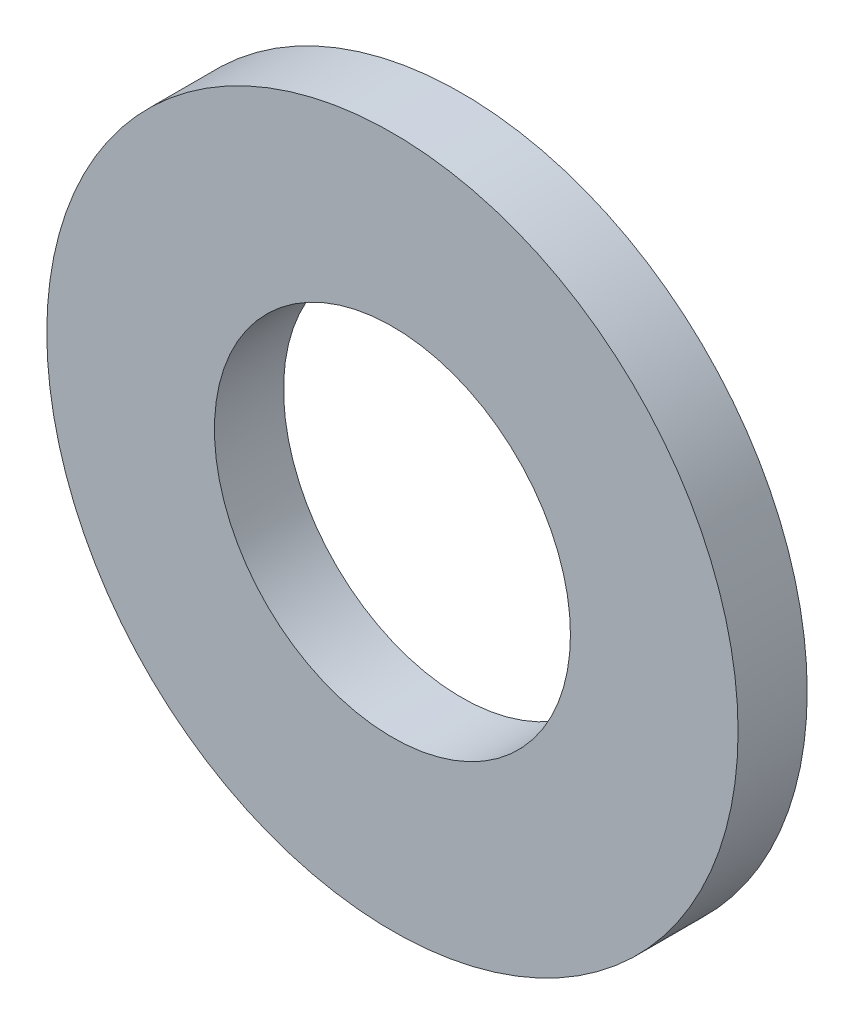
ISO-10303-21;
HEADER;
FILE_DESCRIPTION(('STEP AP214'),'2;1');
FILE_NAME('part.step','',(''),(''),'','','');
FILE_SCHEMA(('AUTOMOTIVE_DESIGN { 1 0 10303 214 1 1 1 1 }'));
ENDSEC;
DATA;
#1=APPLICATION_CONTEXT('core data for automotive mechanical design processes');
#2=APPLICATION_PROTOCOL_DEFINITION('international standard','automotive_design',2000,#1);
#3=PRODUCT_CONTEXT('',#1,'mechanical');
#4=PRODUCT('Part','Part','',(#3));
#5=PRODUCT_RELATED_PRODUCT_CATEGORY('part','',(#4));
#6=PRODUCT_DEFINITION_FORMATION('','',#4);
#7=PRODUCT_DEFINITION_CONTEXT('part definition',#1,'design');
#8=PRODUCT_DEFINITION('design','',#6,#7);
#9=PRODUCT_DEFINITION_SHAPE('','',#8);
#10=(LENGTH_UNIT() NAMED_UNIT(*) SI_UNIT(.MILLI.,.METRE.));
#11=(NAMED_UNIT(*) PLANE_ANGLE_UNIT() SI_UNIT($,.RADIAN.));
#12=(NAMED_UNIT(*) SI_UNIT($,.STERADIAN.) SOLID_ANGLE_UNIT());
#13=UNCERTAINTY_MEASURE_WITH_UNIT(LENGTH_MEASURE(1.E-05),#10,'distance_accuracy_value','');
#14=(GEOMETRIC_REPRESENTATION_CONTEXT(3) GLOBAL_UNCERTAINTY_ASSIGNED_CONTEXT((#13)) GLOBAL_UNIT_ASSIGNED_CONTEXT((#10,
#11,#12)) REPRESENTATION_CONTEXT('',''));
#15=CARTESIAN_POINT('',(0.,0.,0.));
#16=DIRECTION('',(0.,0.,1.));
#17=DIRECTION('',(1.,0.,0.));
#18=AXIS2_PLACEMENT_3D('',#15,#16,#17);
#19=CARTESIAN_POINT('',(-30.6252380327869,42.4041757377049,2.));
#20=DIRECTION('',(0.,0.,1.));
#21=DIRECTION('',(1.,0.,0.));
#22=AXIS2_PLACEMENT_3D('',#19,#20,#21);
#23=PLANE('',#22);
#24=CARTESIAN_POINT('',(-30.6252380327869,42.4041757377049,2.));
#25=DIRECTION('',(0.,0.,1.));
#26=DIRECTION('',(1.,0.,0.));
#27=AXIS2_PLACEMENT_3D('',#24,#25,#26);
#28=CIRCLE('',#27,10.);
#29=CARTESIAN_POINT('',(-20.6252380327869,42.4041757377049,2.));
#30=VERTEX_POINT('',#29);
#31=EDGE_CURVE('E10',#30,#30,#28,.T.);
#32=ORIENTED_EDGE('',*,*,#31,.T.);
#33=EDGE_LOOP('',(#32));
#34=FACE_BOUND('',#33,.T.);
#35=CARTESIAN_POINT('',(-30.6252380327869,42.4041757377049,2.));
#36=DIRECTION('',(0.,0.,1.));
#37=DIRECTION('',(1.,0.,0.));
#38=AXIS2_PLACEMENT_3D('',#35,#36,#37);
#39=CIRCLE('',#38,5.15);
#40=CARTESIAN_POINT('',(-25.4752380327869,42.4041757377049,2.));
#41=VERTEX_POINT('',#40);
#42=EDGE_CURVE('E46',#41,#41,#39,.T.);
#43=ORIENTED_EDGE('',*,*,#42,.F.);
#44=EDGE_LOOP('',(#43));
#45=FACE_BOUND('',#44,.T.);
#46=ADVANCED_FACE('F35',(#34,#45),#23,.T.);
#47=CARTESIAN_POINT('',(-30.6252380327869,42.4041757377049,0.));
#48=DIRECTION('',(0.,0.,1.));
#49=DIRECTION('',(1.,0.,0.));
#50=AXIS2_PLACEMENT_3D('',#47,#48,#49);
#51=PLANE('',#50);
#52=CARTESIAN_POINT('',(-30.6252380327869,42.4041757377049,0.));
#53=DIRECTION('',(0.,0.,1.));
#54=DIRECTION('',(1.,0.,0.));
#55=AXIS2_PLACEMENT_3D('',#52,#53,#54);
#56=CIRCLE('',#55,10.);
#57=CARTESIAN_POINT('',(-20.6252380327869,42.4041757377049,0.));
#58=VERTEX_POINT('',#57);
#59=EDGE_CURVE('E39',#58,#58,#56,.T.);
#60=ORIENTED_EDGE('',*,*,#59,.F.);
#61=EDGE_LOOP('',(#60));
#62=FACE_BOUND('',#61,.T.);
#63=CARTESIAN_POINT('',(-30.6252380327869,42.4041757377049,0.));
#64=DIRECTION('',(0.,0.,1.));
#65=DIRECTION('',(1.,0.,0.));
#66=AXIS2_PLACEMENT_3D('',#63,#64,#65);
#67=CIRCLE('',#66,5.15);
#68=CARTESIAN_POINT('',(-25.4752380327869,42.4041757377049,0.));
#69=VERTEX_POINT('',#68);
#70=EDGE_CURVE('E48',#69,#69,#67,.T.);
#71=ORIENTED_EDGE('',*,*,#70,.T.);
#72=EDGE_LOOP('',(#71));
#73=FACE_BOUND('',#72,.T.);
#74=ADVANCED_FACE('F58',(#62,#73),#51,.F.);
#75=CARTESIAN_POINT('',(-30.6252380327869,42.4041757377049,2.));
#76=DIRECTION('',(0.,0.,-1.));
#77=DIRECTION('',(-1.,0.,0.));
#78=AXIS2_PLACEMENT_3D('',#75,#76,#77);
#79=CYLINDRICAL_SURFACE('',#78,10.);
#80=ORIENTED_EDGE('',*,*,#31,.F.);
#81=EDGE_LOOP('',(#80));
#82=FACE_BOUND('',#81,.T.);
#83=ORIENTED_EDGE('',*,*,#59,.T.);
#84=EDGE_LOOP('',(#83));
#85=FACE_BOUND('',#84,.T.);
#86=ADVANCED_FACE('F37',(#82,#85),#79,.T.);
#87=CARTESIAN_POINT('',(-30.6252380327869,42.4041757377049,2.));
#88=DIRECTION('',(0.,0.,-1.));
#89=DIRECTION('',(-1.,0.,0.));
#90=AXIS2_PLACEMENT_3D('',#87,#88,#89);
#91=CYLINDRICAL_SURFACE('',#90,5.15);
#92=ORIENTED_EDGE('',*,*,#42,.T.);
#93=EDGE_LOOP('',(#92));
#94=FACE_BOUND('',#93,.T.);
#95=ORIENTED_EDGE('',*,*,#70,.F.);
#96=EDGE_LOOP('',(#95));
#97=FACE_BOUND('',#96,.T.);
#98=ADVANCED_FACE('F54',(#94,#97),#91,.F.);
#99=CLOSED_SHELL('',(#46,#74,#86,#98));
#100=MANIFOLD_SOLID_BREP('B2',#99);
#101=ADVANCED_BREP_SHAPE_REPRESENTATION('',(#18,#100),#14);
#102=SHAPE_DEFINITION_REPRESENTATION(#9,#101);
ENDSEC;
END-ISO-10303-21;
